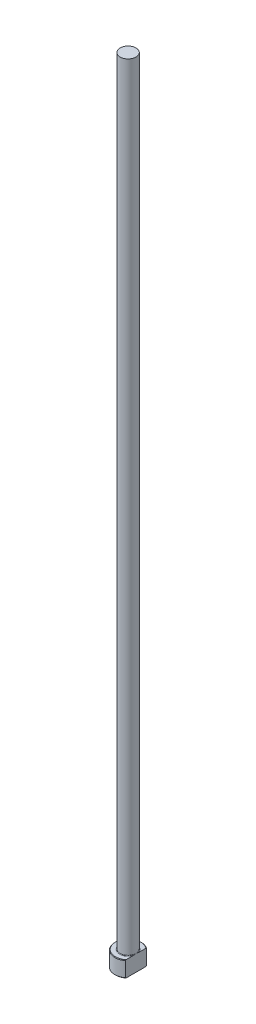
ISO-10303-21;
HEADER;
FILE_DESCRIPTION(('STEP AP214'),'2;1');
FILE_NAME('part.step','',(''),(''),'','','');
FILE_SCHEMA(('AUTOMOTIVE_DESIGN { 1 0 10303 214 1 1 1 1 }'));
ENDSEC;
DATA;
#1=APPLICATION_CONTEXT('core data for automotive mechanical design processes');
#2=APPLICATION_PROTOCOL_DEFINITION('international standard','automotive_design',2000,#1);
#3=PRODUCT_CONTEXT('',#1,'mechanical');
#4=PRODUCT('Part','Part','',(#3));
#5=PRODUCT_RELATED_PRODUCT_CATEGORY('part','',(#4));
#6=PRODUCT_DEFINITION_FORMATION('','',#4);
#7=PRODUCT_DEFINITION_CONTEXT('part definition',#1,'design');
#8=PRODUCT_DEFINITION('design','',#6,#7);
#9=PRODUCT_DEFINITION_SHAPE('','',#8);
#10=(LENGTH_UNIT() NAMED_UNIT(*) SI_UNIT(.MILLI.,.METRE.));
#11=(NAMED_UNIT(*) PLANE_ANGLE_UNIT() SI_UNIT($,.RADIAN.));
#12=(NAMED_UNIT(*) SI_UNIT($,.STERADIAN.) SOLID_ANGLE_UNIT());
#13=UNCERTAINTY_MEASURE_WITH_UNIT(LENGTH_MEASURE(1.E-05),#10,'distance_accuracy_value','');
#14=(GEOMETRIC_REPRESENTATION_CONTEXT(3) GLOBAL_UNCERTAINTY_ASSIGNED_CONTEXT((#13)) GLOBAL_UNIT_ASSIGNED_CONTEXT((#10,
#11,#12)) REPRESENTATION_CONTEXT('',''));
#15=CARTESIAN_POINT('',(0.,0.,0.));
#16=DIRECTION('',(0.,0.,1.));
#17=DIRECTION('',(1.,0.,0.));
#18=AXIS2_PLACEMENT_3D('',#15,#16,#17);
#19=CARTESIAN_POINT('',(0.,0.,0.));
#20=DIRECTION('',(0.,-1.,0.));
#21=DIRECTION('',(0.,0.,-1.));
#22=AXIS2_PLACEMENT_3D('',#19,#20,#21);
#23=PLANE('',#22);
#24=CARTESIAN_POINT('',(0.,0.,0.));
#25=DIRECTION('',(0.,-1.,0.));
#26=DIRECTION('',(0.,0.,-1.));
#27=AXIS2_PLACEMENT_3D('',#24,#25,#26);
#28=CIRCLE('',#27,4.79999999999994);
#29=CARTESIAN_POINT('',(2.99999999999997,0.,3.74699879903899));
#30=VERTEX_POINT('',#29);
#31=CARTESIAN_POINT('',(2.99999999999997,0.,-3.74699879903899));
#32=VERTEX_POINT('',#31);
#33=EDGE_CURVE('E98',#30,#32,#28,.T.);
#34=ORIENTED_EDGE('',*,*,#33,.T.);
#35=DIRECTION('',(0.,0.,1.));
#36=VECTOR('',#35,1.);
#37=CARTESIAN_POINT('',(2.99999999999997,0.,3.99999999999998));
#38=LINE('',#37,#36);
#39=EDGE_CURVE('E83',#32,#30,#38,.T.);
#40=ORIENTED_EDGE('',*,*,#39,.T.);
#41=EDGE_LOOP('',(#34,#40));
#42=FACE_BOUND('',#41,.T.);
#43=ADVANCED_FACE('F32',(#42),#23,.T.);
#44=CARTESIAN_POINT('',(0.,259.958771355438,0.));
#45=DIRECTION('',(0.,1.,0.));
#46=DIRECTION('',(0.,0.,1.));
#47=AXIS2_PLACEMENT_3D('',#44,#45,#46);
#48=CYLINDRICAL_SURFACE('',#47,4.99999999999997);
#49=CARTESIAN_POINT('',(0.,5.79999999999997,0.));
#50=DIRECTION('',(0.,1.,0.));
#51=DIRECTION('',(0.,0.,1.));
#52=AXIS2_PLACEMENT_3D('',#49,#50,#51);
#53=CIRCLE('',#52,4.99999999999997);
#54=CARTESIAN_POINT('',(2.99999999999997,5.79999999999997,3.99999999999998));
#55=VERTEX_POINT('',#54);
#56=CARTESIAN_POINT('',(2.99999999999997,5.79999999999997,-3.99999999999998));
#57=VERTEX_POINT('',#56);
#58=EDGE_CURVE('E104',#55,#57,#53,.F.);
#59=ORIENTED_EDGE('',*,*,#58,.T.);
#60=DIRECTION('',(0.,-1.,0.));
#61=VECTOR('',#60,1.);
#62=CARTESIAN_POINT('',(2.99999999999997,300.,-3.99999999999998));
#63=LINE('',#62,#61);
#64=CARTESIAN_POINT('',(2.99999999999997,0.200000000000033,-3.99999999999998));
#65=VERTEX_POINT('',#64);
#66=EDGE_CURVE('E183',#57,#65,#63,.T.);
#67=ORIENTED_EDGE('',*,*,#66,.T.);
#68=CARTESIAN_POINT('',(0.,0.200000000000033,0.));
#69=DIRECTION('',(0.,-1.,0.));
#70=DIRECTION('',(0.,0.,-1.));
#71=AXIS2_PLACEMENT_3D('',#68,#69,#70);
#72=CIRCLE('',#71,4.99999999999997);
#73=CARTESIAN_POINT('',(2.99999999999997,0.200000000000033,3.99999999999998));
#74=VERTEX_POINT('',#73);
#75=EDGE_CURVE('E100',#65,#74,#72,.F.);
#76=ORIENTED_EDGE('',*,*,#75,.T.);
#77=DIRECTION('',(0.,-1.,0.));
#78=VECTOR('',#77,1.);
#79=CARTESIAN_POINT('',(2.99999999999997,300.,3.99999999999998));
#80=LINE('',#79,#78);
#81=EDGE_CURVE('E93',#55,#74,#80,.T.);
#82=ORIENTED_EDGE('',*,*,#81,.F.);
#83=EDGE_LOOP('',(#59,#67,#76,#82));
#84=FACE_BOUND('',#83,.T.);
#85=ADVANCED_FACE('F158',(#84),#48,.T.);
#86=CARTESIAN_POINT('',(-4.99999999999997,6.,0.));
#87=DIRECTION('',(0.,1.,0.));
#88=DIRECTION('',(0.,0.,1.));
#89=AXIS2_PLACEMENT_3D('',#86,#87,#88);
#90=PLANE('',#89);
#91=CARTESIAN_POINT('',(0.,6.,0.));
#92=DIRECTION('',(0.,1.,0.));
#93=DIRECTION('',(0.,0.,1.));
#94=AXIS2_PLACEMENT_3D('',#91,#92,#93);
#95=CIRCLE('',#94,4.79999999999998);
#96=CARTESIAN_POINT('',(2.99999999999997,6.,-3.74699879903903));
#97=VERTEX_POINT('',#96);
#98=CARTESIAN_POINT('',(2.99999999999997,6.,3.74699879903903));
#99=VERTEX_POINT('',#98);
#100=EDGE_CURVE('E178',#97,#99,#95,.T.);
#101=ORIENTED_EDGE('',*,*,#100,.T.);
#102=DIRECTION('',(0.,0.,-1.));
#103=VECTOR('',#102,1.);
#104=CARTESIAN_POINT('',(2.99999999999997,6.,0.));
#105=LINE('',#104,#103);
#106=CARTESIAN_POINT('',(2.99999999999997,5.99999999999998,1.11355287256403));
#107=VERTEX_POINT('',#106);
#108=EDGE_CURVE('E57',#99,#107,#105,.T.);
#109=ORIENTED_EDGE('',*,*,#108,.T.);
#110=CARTESIAN_POINT('',(0.,6.,0.));
#111=DIRECTION('',(0.,1.,0.));
#112=DIRECTION('',(0.,0.,1.));
#113=AXIS2_PLACEMENT_3D('',#110,#111,#112);
#114=CIRCLE('',#113,3.19999999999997);
#115=CARTESIAN_POINT('',(2.99999999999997,5.99999999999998,-1.113552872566));
#116=VERTEX_POINT('',#115);
#117=EDGE_CURVE('E107',#107,#116,#114,.F.);
#118=ORIENTED_EDGE('',*,*,#117,.T.);
#119=EDGE_CURVE('E136',#116,#97,#105,.T.);
#120=ORIENTED_EDGE('',*,*,#119,.T.);
#121=EDGE_LOOP('',(#101,#109,#118,#120));
#122=FACE_BOUND('',#121,.T.);
#123=ADVANCED_FACE('F147',(#122),#90,.T.);
#124=CARTESIAN_POINT('',(0.,6.00000000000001,0.));
#125=DIRECTION('',(0.,-1.,0.));
#126=DIRECTION('',(0.,0.,-1.));
#127=AXIS2_PLACEMENT_3D('',#124,#125,#126);
#128=CONICAL_SURFACE('',#127,4.79999999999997,0.785398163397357);
#129=ORIENTED_EDGE('',*,*,#58,.F.);
#130=CARTESIAN_POINT('',(2.99999999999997,1.50107969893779,8.80169976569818));
#131=CARTESIAN_POINT('',(2.99999999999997,1.63686222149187,8.65824370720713));
#132=CARTESIAN_POINT('',(2.99999999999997,1.77246571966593,8.51461803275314));
#133=CARTESIAN_POINT('',(2.99999999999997,2.04325136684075,8.22696847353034));
#134=CARTESIAN_POINT('',(2.99999999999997,2.17843351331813,8.08294458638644));
#135=CARTESIAN_POINT('',(2.99999999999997,2.58356488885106,7.64985367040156));
#136=CARTESIAN_POINT('',(2.99999999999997,2.85278243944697,7.36010130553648));
#137=CARTESIAN_POINT('',(2.99999999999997,3.40003551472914,6.76562093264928));
#138=CARTESIAN_POINT('',(2.99999999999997,3.67795327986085,6.46078413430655));
#139=CARTESIAN_POINT('',(2.99999999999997,4.09143431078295,6.00077575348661));
#140=CARTESIAN_POINT('',(2.99999999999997,4.22862197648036,5.84706478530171));
#141=CARTESIAN_POINT('',(2.99999999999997,4.50164803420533,5.5384501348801));
#142=CARTESIAN_POINT('',(2.99999999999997,4.63748643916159,5.38354646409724));
#143=CARTESIAN_POINT('',(2.99999999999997,4.90727601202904,5.07249257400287));
#144=CARTESIAN_POINT('',(2.99999999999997,5.04122961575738,4.91634447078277));
#145=CARTESIAN_POINT('',(2.99999999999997,5.30697993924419,4.60220522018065));
#146=CARTESIAN_POINT('',(2.99999999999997,5.43877654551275,4.44421397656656));
#147=CARTESIAN_POINT('',(2.99999999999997,5.69999683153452,4.12534042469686));
#148=CARTESIAN_POINT('',(2.99999999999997,5.82941047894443,3.96444987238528));
#149=CARTESIAN_POINT('',(2.99999999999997,6.08438250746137,3.63966784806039));
#150=CARTESIAN_POINT('',(2.99999999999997,6.20994148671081,3.47577684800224));
#151=CARTESIAN_POINT('',(2.99999999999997,6.45325581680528,3.14739812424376));
#152=CARTESIAN_POINT('',(2.99999999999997,6.57111776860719,2.98298986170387));
#153=CARTESIAN_POINT('',(2.99999999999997,6.79968625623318,2.64903166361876));
#154=CARTESIAN_POINT('',(2.99999999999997,6.91038738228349,2.479477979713));
#155=CARTESIAN_POINT('',(2.99999999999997,7.12046597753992,2.13484547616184));
#156=CARTESIAN_POINT('',(2.99999999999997,7.21990868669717,1.95980688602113));
#157=CARTESIAN_POINT('',(2.99999999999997,7.40271732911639,1.60161809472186));
#158=CARTESIAN_POINT('',(2.99999999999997,7.48611382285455,1.4184841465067));
#159=CARTESIAN_POINT('',(2.99999999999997,7.59087391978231,1.14242184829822));
#160=CARTESIAN_POINT('',(2.99999999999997,7.62169870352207,1.05308812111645));
#161=CARTESIAN_POINT('',(2.99999999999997,7.67691431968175,0.872393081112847));
#162=CARTESIAN_POINT('',(2.99999999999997,7.70130307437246,0.781031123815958));
#163=CARTESIAN_POINT('',(2.99999999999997,7.74245942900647,0.597105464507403));
#164=CARTESIAN_POINT('',(2.99999999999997,7.75926776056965,0.504551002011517));
#165=CARTESIAN_POINT('',(2.99999999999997,7.78456917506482,0.318316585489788));
#166=CARTESIAN_POINT('',(2.99999999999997,7.79306431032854,0.224636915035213));
#167=CARTESIAN_POINT('',(2.99999999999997,7.8012672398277,0.0362345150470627));
#168=CARTESIAN_POINT('',(2.99999999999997,7.80091364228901,-0.0584909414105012));
#169=CARTESIAN_POINT('',(2.99999999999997,7.79128992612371,-0.247479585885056));
#170=CARTESIAN_POINT('',(2.99999999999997,7.78201974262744,-0.341742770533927));
#171=CARTESIAN_POINT('',(2.99999999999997,7.75505711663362,-0.529484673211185));
#172=CARTESIAN_POINT('',(2.99999999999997,7.73732579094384,-0.622957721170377));
#173=CARTESIAN_POINT('',(2.99999999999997,7.69436193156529,-0.808152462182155));
#174=CARTESIAN_POINT('',(2.99999999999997,7.66912783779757,-0.899873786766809));
#175=CARTESIAN_POINT('',(2.99999999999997,7.59536615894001,-1.13513447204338));
#176=CARTESIAN_POINT('',(2.99999999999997,7.54190202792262,-1.2771229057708));
#177=CARTESIAN_POINT('',(2.99999999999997,7.4228806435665,-1.55591594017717));
#178=CARTESIAN_POINT('',(2.99999999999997,7.35731341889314,-1.69271615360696));
#179=CARTESIAN_POINT('',(2.99999999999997,7.21673004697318,-1.9629734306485));
#180=CARTESIAN_POINT('',(2.99999999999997,7.14163008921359,-2.09638641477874));
#181=CARTESIAN_POINT('',(2.99999999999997,7.02409885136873,-2.29351148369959));
#182=CARTESIAN_POINT('',(2.99999999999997,6.98411579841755,-2.3587093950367));
#183=CARTESIAN_POINT('',(2.99999999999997,6.90273519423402,-2.48821412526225));
#184=CARTESIAN_POINT('',(2.99999999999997,6.86133769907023,-2.55252097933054));
#185=CARTESIAN_POINT('',(2.99999999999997,6.72108058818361,-2.76592084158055));
#186=CARTESIAN_POINT('',(2.99999999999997,6.619509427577,-2.91323263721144));
#187=CARTESIAN_POINT('',(2.99999999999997,6.4115868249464,-3.20445576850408));
#188=CARTESIAN_POINT('',(2.99999999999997,6.30523434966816,-3.34836635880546));
#189=CARTESIAN_POINT('',(2.99999999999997,6.08891481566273,-3.63358820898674));
#190=CARTESIAN_POINT('',(2.99999999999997,5.9789453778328,-3.77489765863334));
#191=CARTESIAN_POINT('',(2.99999999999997,5.75630759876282,-4.05537908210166));
#192=CARTESIAN_POINT('',(2.99999999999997,5.64363910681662,-4.19455093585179));
#193=CARTESIAN_POINT('',(2.99999999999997,5.41585487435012,-4.47160548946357));
#194=CARTESIAN_POINT('',(2.99999999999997,5.3007325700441,-4.60948278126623));
#195=CARTESIAN_POINT('',(2.99999999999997,5.0688195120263,-4.88382857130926));
#196=CARTESIAN_POINT('',(2.99999999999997,4.95202872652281,-5.02029704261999));
#197=CARTESIAN_POINT('',(2.99999999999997,4.59976429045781,-5.42786401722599));
#198=CARTESIAN_POINT('',(2.99999999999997,4.36230070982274,-5.69724186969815));
#199=CARTESIAN_POINT('',(2.99999999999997,3.90791057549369,-6.20584337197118));
#200=CARTESIAN_POINT('',(2.99999999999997,3.69132371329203,-6.4453721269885));
#201=CARTESIAN_POINT('',(2.99999999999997,3.25600753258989,-6.92252604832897));
#202=CARTESIAN_POINT('',(2.99999999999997,3.03727796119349,-7.16015098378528));
#203=CARTESIAN_POINT('',(2.99999999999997,2.59963438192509,-7.63242038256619));
#204=CARTESIAN_POINT('',(2.99999999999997,2.38073043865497,-7.86707418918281));
#205=CARTESIAN_POINT('',(2.99999999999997,1.94172655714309,-8.33519393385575));
#206=CARTESIAN_POINT('',(2.99999999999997,1.7216268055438,-8.56866004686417));
#207=CARTESIAN_POINT('',(2.99999999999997,1.50107969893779,-8.80169976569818));
#208=B_SPLINE_CURVE_WITH_KNOTS('',3,(#130,#131,#132,#133,#134,#135,#136,#137,#138,#139,#140,
#141,#142,#143,#144,#145,#146,#147,#148,#149,#150,#151,#152,#153,#154,#155,#156,#157,#158,#159,
#160,#161,#162,#163,#164,#165,#166,#167,#168,#169,#170,#171,#172,#173,#174,#175,#176,#177,#178,
#179,#180,#181,#182,#183,#184,#185,#186,#187,#188,#189,#190,#191,#192,#193,#194,#195,#196,#197,
#198,#199,#200,#201,#202,#203,#204,#205,#206,#207),.UNSPECIFIED.,.F.,.F.,(4,2,2,2,2,2,2,2,2,2,2,
2,2,2,2,2,2,2,2,2,2,2,2,2,2,2,2,2,2,2,2,2,2,2,2,2,2,2,4),(0.,0.592578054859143,1.18515965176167,
2.3717032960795,3.60919781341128,4.2272757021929,4.84534766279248,5.46252965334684,
6.07974401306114,6.69913968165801,7.31843874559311,7.92518229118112,8.53237898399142,
9.13585442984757,9.73816890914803,10.0214813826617,10.3048852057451,10.5867475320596,
10.8685402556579,11.1522885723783,11.4360389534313,11.721106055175,12.006232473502,
12.4605654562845,12.915274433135,13.3743011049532,13.6037325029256,13.8331548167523,
14.3698070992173,14.9065759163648,15.4437051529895,15.9808644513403,16.5197074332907,
17.0585606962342,18.1358079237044,19.1045853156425,20.0734784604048,21.0361950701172,
21.9987655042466),.UNSPECIFIED.);
#209=EDGE_CURVE('E135',#55,#99,#208,.T.);
#210=ORIENTED_EDGE('',*,*,#209,.T.);
#211=ORIENTED_EDGE('',*,*,#100,.F.);
#212=EDGE_CURVE('E127',#97,#57,#208,.T.);
#213=ORIENTED_EDGE('',*,*,#212,.T.);
#214=EDGE_LOOP('',(#129,#210,#211,#213));
#215=FACE_BOUND('',#214,.T.);
#216=ADVANCED_FACE('F143',(#215),#128,.T.);
#217=CARTESIAN_POINT('',(0.,0.200000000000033,0.));
#218=DIRECTION('',(0.,1.,0.));
#219=DIRECTION('',(0.,0.,1.));
#220=AXIS2_PLACEMENT_3D('',#217,#218,#219);
#221=CONICAL_SURFACE('',#220,4.99999999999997,0.785398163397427);
#222=ORIENTED_EDGE('',*,*,#75,.F.);
#223=CARTESIAN_POINT('',(2.99999999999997,4.49892030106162,-8.80169976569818));
#224=CARTESIAN_POINT('',(2.99999999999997,4.36313777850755,-8.65824370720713));
#225=CARTESIAN_POINT('',(2.99999999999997,4.22753428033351,-8.51461803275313));
#226=CARTESIAN_POINT('',(2.99999999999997,3.95674863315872,-8.22696847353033));
#227=CARTESIAN_POINT('',(2.99999999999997,3.82156648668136,-8.08294458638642));
#228=CARTESIAN_POINT('',(2.99999999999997,3.41643511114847,-7.64985367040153));
#229=CARTESIAN_POINT('',(2.99999999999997,3.14721756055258,-7.36010130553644));
#230=CARTESIAN_POINT('',(2.99999999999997,2.59996448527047,-6.76562093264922));
#231=CARTESIAN_POINT('',(2.99999999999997,2.32204672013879,-6.46078413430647));
#232=CARTESIAN_POINT('',(2.99999999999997,1.90856568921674,-6.00077575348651));
#233=CARTESIAN_POINT('',(2.99999999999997,1.77137802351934,-5.84706478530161));
#234=CARTESIAN_POINT('',(2.99999999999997,1.4983519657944,-5.53845013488));
#235=CARTESIAN_POINT('',(2.99999999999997,1.36251356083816,-5.38354646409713));
#236=CARTESIAN_POINT('',(2.99999999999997,1.09272398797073,-5.07249257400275));
#237=CARTESIAN_POINT('',(2.99999999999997,0.958770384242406,-4.91634447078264));
#238=CARTESIAN_POINT('',(2.99999999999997,0.693020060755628,-4.60220522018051));
#239=CARTESIAN_POINT('',(2.99999999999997,0.561223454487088,-4.44421397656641));
#240=CARTESIAN_POINT('',(2.99999999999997,0.300003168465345,-4.1253404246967));
#241=CARTESIAN_POINT('',(2.99999999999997,0.170589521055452,-3.96444987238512));
#242=CARTESIAN_POINT('',(2.99999999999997,-0.0843825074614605,-3.63966784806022));
#243=CARTESIAN_POINT('',(2.99999999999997,-0.209941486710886,-3.47577684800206));
#244=CARTESIAN_POINT('',(2.99999999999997,-0.453255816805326,-3.14739812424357));
#245=CARTESIAN_POINT('',(2.99999999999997,-0.57111776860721,-2.98298986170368));
#246=CARTESIAN_POINT('',(2.99999999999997,-0.799686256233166,-2.64903166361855));
#247=CARTESIAN_POINT('',(2.99999999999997,-0.910387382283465,-2.47947797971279));
#248=CARTESIAN_POINT('',(2.99999999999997,-1.12046597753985,-2.13484547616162));
#249=CARTESIAN_POINT('',(2.99999999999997,-1.21990868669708,-1.95980688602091));
#250=CARTESIAN_POINT('',(2.99999999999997,-1.40271732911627,-1.60161809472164));
#251=CARTESIAN_POINT('',(2.99999999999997,-1.4861138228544,-1.41848414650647));
#252=CARTESIAN_POINT('',(2.99999999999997,-1.59087391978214,-1.14242184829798));
#253=CARTESIAN_POINT('',(2.99999999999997,-1.62169870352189,-1.0530881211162));
#254=CARTESIAN_POINT('',(2.99999999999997,-1.67691431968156,-0.872393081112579));
#255=CARTESIAN_POINT('',(2.99999999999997,-1.70130307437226,-0.781031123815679));
#256=CARTESIAN_POINT('',(2.99999999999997,-1.74245942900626,-0.597105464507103));
#257=CARTESIAN_POINT('',(2.99999999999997,-1.75926776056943,-0.504551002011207));
#258=CARTESIAN_POINT('',(2.99999999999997,-1.78456917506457,-0.318316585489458));
#259=CARTESIAN_POINT('',(2.99999999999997,-1.79306431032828,-0.224636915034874));
#260=CARTESIAN_POINT('',(2.99999999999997,-1.80126723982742,-0.0362345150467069));
#261=CARTESIAN_POINT('',(2.99999999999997,-1.80091364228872,0.0584909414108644));
#262=CARTESIAN_POINT('',(2.99999999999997,-1.7912899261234,0.247479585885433));
#263=CARTESIAN_POINT('',(2.99999999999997,-1.78201974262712,0.341742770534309));
#264=CARTESIAN_POINT('',(2.99999999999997,-1.75505711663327,0.529484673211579));
#265=CARTESIAN_POINT('',(2.99999999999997,-1.73732579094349,0.622957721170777));
#266=CARTESIAN_POINT('',(2.99999999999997,-1.69436193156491,0.808152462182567));
#267=CARTESIAN_POINT('',(2.99999999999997,-1.66912783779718,0.899873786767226));
#268=CARTESIAN_POINT('',(2.99999999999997,-1.59536615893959,1.13513447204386));
#269=CARTESIAN_POINT('',(2.99999999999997,-1.54190202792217,1.27712290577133));
#270=CARTESIAN_POINT('',(2.99999999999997,-1.42288064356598,1.55591594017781));
#271=CARTESIAN_POINT('',(2.99999999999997,-1.35731341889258,1.69271615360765));
#272=CARTESIAN_POINT('',(2.99999999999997,-1.21673004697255,1.96297343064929));
#273=CARTESIAN_POINT('',(2.99999999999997,-1.14163008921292,2.09638641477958));
#274=CARTESIAN_POINT('',(2.99999999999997,-1.024098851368,2.2935114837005));
#275=CARTESIAN_POINT('',(2.99999999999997,-0.984115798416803,2.35870939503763));
#276=CARTESIAN_POINT('',(2.99999999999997,-0.902735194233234,2.48821412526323));
#277=CARTESIAN_POINT('',(2.99999999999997,-0.861337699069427,2.55252097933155));
#278=CARTESIAN_POINT('',(2.99999999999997,-0.721080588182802,2.76592084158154));
#279=CARTESIAN_POINT('',(2.99999999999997,-0.619509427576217,2.91323263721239));
#280=CARTESIAN_POINT('',(2.99999999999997,-0.411586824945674,3.20445576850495));
#281=CARTESIAN_POINT('',(2.99999999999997,-0.305234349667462,3.34836635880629));
#282=CARTESIAN_POINT('',(2.99999999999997,-0.0889148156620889,3.6335882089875));
#283=CARTESIAN_POINT('',(2.99999999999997,0.0210546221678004,3.77489765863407));
#284=CARTESIAN_POINT('',(2.99999999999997,0.243692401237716,4.05537908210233));
#285=CARTESIAN_POINT('',(2.99999999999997,0.356360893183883,4.19455093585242));
#286=CARTESIAN_POINT('',(2.99999999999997,0.584145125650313,4.47160548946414));
#287=CARTESIAN_POINT('',(2.99999999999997,0.699267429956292,4.60948278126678));
#288=CARTESIAN_POINT('',(2.99999999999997,0.931180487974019,4.88382857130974));
#289=CARTESIAN_POINT('',(2.99999999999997,1.04797127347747,5.02029704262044));
#290=CARTESIAN_POINT('',(2.99999999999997,1.40023570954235,5.42786401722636));
#291=CARTESIAN_POINT('',(2.99999999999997,1.63769929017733,5.69724186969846));
#292=CARTESIAN_POINT('',(2.99999999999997,2.09208942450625,6.20584337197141));
#293=CARTESIAN_POINT('',(2.99999999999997,2.30867628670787,6.4453721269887));
#294=CARTESIAN_POINT('',(2.99999999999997,2.74399246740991,6.92252604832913));
#295=CARTESIAN_POINT('',(2.99999999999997,2.96272203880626,7.16015098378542));
#296=CARTESIAN_POINT('',(2.99999999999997,3.40036561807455,7.63242038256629));
#297=CARTESIAN_POINT('',(2.99999999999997,3.61926956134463,7.86707418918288));
#298=CARTESIAN_POINT('',(2.99999999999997,4.05827344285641,8.33519393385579));
#299=CARTESIAN_POINT('',(2.99999999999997,4.27837319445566,8.56866004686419));
#300=CARTESIAN_POINT('',(2.99999999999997,4.49892030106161,8.80169976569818));
#301=B_SPLINE_CURVE_WITH_KNOTS('',3,(#223,#224,#225,#226,#227,#228,#229,#230,#231,#232,#233,
#234,#235,#236,#237,#238,#239,#240,#241,#242,#243,#244,#245,#246,#247,#248,#249,#250,#251,#252,
#253,#254,#255,#256,#257,#258,#259,#260,#261,#262,#263,#264,#265,#266,#267,#268,#269,#270,#271,
#272,#273,#274,#275,#276,#277,#278,#279,#280,#281,#282,#283,#284,#285,#286,#287,#288,#289,#290,
#291,#292,#293,#294,#295,#296,#297,#298,#299,#300),.UNSPECIFIED.,.F.,.F.,(4,2,2,2,2,2,2,2,2,2,2,
2,2,2,2,2,2,2,2,2,2,2,2,2,2,2,2,2,2,2,2,2,2,2,2,2,2,2,4),(0.,0.592578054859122,1.18515965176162,
2.37170329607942,3.60919781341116,4.22727570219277,4.84534766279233,5.46252965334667,
6.07974401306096,6.69913968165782,7.3184387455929,7.92518229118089,8.53237898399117,
9.1358544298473,9.73816890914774,10.0214813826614,10.3048852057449,10.5867475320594,
10.8685402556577,11.1522885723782,11.4360389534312,11.7211060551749,12.0062324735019,
12.4605654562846,12.9152744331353,13.3743011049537,13.6037325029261,13.8331548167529,
14.3698070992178,14.9065759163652,15.4437051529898,15.9808644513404,16.5197074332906,
17.058560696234,18.1358079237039,19.1045853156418,20.073478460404,21.0361950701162,
21.9987655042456),.UNSPECIFIED.);
#302=EDGE_CURVE('E86',#65,#32,#301,.T.);
#303=ORIENTED_EDGE('',*,*,#302,.T.);
#304=ORIENTED_EDGE('',*,*,#33,.F.);
#305=EDGE_CURVE('E89',#30,#74,#301,.T.);
#306=ORIENTED_EDGE('',*,*,#305,.T.);
#307=EDGE_LOOP('',(#222,#303,#304,#306));
#308=FACE_BOUND('',#307,.T.);
#309=ADVANCED_FACE('F97',(#308),#221,.T.);
#310=CARTESIAN_POINT('',(0.,6.19999999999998,0.));
#311=DIRECTION('',(0.,1.,0.));
#312=DIRECTION('',(0.,0.,1.));
#313=AXIS2_PLACEMENT_3D('',#310,#311,#312);
#314=TOROIDAL_SURFACE('',#313,3.19999999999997,0.2);
#315=CARTESIAN_POINT('',(2.99999999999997,6.19999999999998,0.));
#316=CARTESIAN_POINT('',(2.99999999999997,6.20000054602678,-8.25590029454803E-09));
#317=CARTESIAN_POINT('',(2.99999999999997,6.20000108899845,-2.22623717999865E-07));
#318=CARTESIAN_POINT('',(2.99999999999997,6.20000210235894,-8.13181332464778E-07));
#319=CARTESIAN_POINT('',(2.99999999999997,6.20000256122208,-1.20262210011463E-06));
#320=CARTESIAN_POINT('',(2.99999999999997,6.20000351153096,-2.13233194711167E-06));
#321=CARTESIAN_POINT('',(2.99999999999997,6.20000398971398,-2.68711080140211E-06));
#322=CARTESIAN_POINT('',(2.99999999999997,6.20000484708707,-3.8372299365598E-06));
#323=CARTESIAN_POINT('',(2.99999999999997,6.20000522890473,-4.43075975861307E-06));
#324=CARTESIAN_POINT('',(2.99999999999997,6.20000663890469,-6.718054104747E-06));
#325=CARTESIAN_POINT('',(2.99999999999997,6.20000758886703,-8.46267334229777E-06));
#326=CARTESIAN_POINT('',(2.99999999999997,6.20000915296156,-1.19195939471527E-05));
#327=CARTESIAN_POINT('',(2.99999999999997,6.20000978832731,-1.36226968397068E-05));
#328=CARTESIAN_POINT('',(2.99999999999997,6.20001243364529,-2.07785329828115E-05));
#329=CARTESIAN_POINT('',(2.99999999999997,6.20001439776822,-2.62512689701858E-05));
#330=CARTESIAN_POINT('',(2.99999999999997,6.20001730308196,-3.65971254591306E-05));
#331=CARTESIAN_POINT('',(2.99999999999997,6.20001835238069,-4.14397204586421E-05));
#332=CARTESIAN_POINT('',(2.99999999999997,6.20002589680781,-7.68826112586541E-05));
#333=CARTESIAN_POINT('',(2.99999999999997,6.20003169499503,-0.000107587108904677));
#334=CARTESIAN_POINT('',(2.99999999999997,6.20005649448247,-0.000225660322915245));
#335=CARTESIAN_POINT('',(2.99999999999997,6.20007997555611,-0.000312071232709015));
#336=CARTESIAN_POINT('',(2.99999999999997,6.20016717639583,-0.00063874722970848));
#337=CARTESIAN_POINT('',(2.99999999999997,6.20022823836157,-0.00087949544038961));
#338=CARTESIAN_POINT('',(2.99999999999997,6.20046253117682,-0.00179757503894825));
#339=CARTESIAN_POINT('',(2.99999999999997,6.20063826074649,-0.00247448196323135));
#340=CARTESIAN_POINT('',(2.99999999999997,6.20145771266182,-0.00563611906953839));
#341=CARTESIAN_POINT('',(2.99999999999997,6.20209802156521,-0.00812138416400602));
#342=CARTESIAN_POINT('',(2.99999999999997,6.20747052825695,-0.0289666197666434));
#343=CARTESIAN_POINT('',(2.99999999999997,6.21221441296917,-0.0473249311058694));
#344=CARTESIAN_POINT('',(2.99999999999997,6.22150414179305,-0.0833908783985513));
#345=CARTESIAN_POINT('',(2.99999999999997,6.22605099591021,-0.101098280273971));
#346=CARTESIAN_POINT('',(2.99999999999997,6.24071513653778,-0.158441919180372));
#347=CARTESIAN_POINT('',(2.99999999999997,6.25076238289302,-0.198096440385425));
#348=CARTESIAN_POINT('',(2.99999999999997,6.2673587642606,-0.264903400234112));
#349=CARTESIAN_POINT('',(2.99999999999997,6.27400650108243,-0.292031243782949));
#350=CARTESIAN_POINT('',(2.99999999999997,6.28691139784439,-0.345693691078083));
#351=CARTESIAN_POINT('',(2.99999999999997,6.2931740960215,-0.372226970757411));
#352=CARTESIAN_POINT('',(2.99999999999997,6.31359314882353,-0.460847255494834));
#353=CARTESIAN_POINT('',(2.99999999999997,6.32711949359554,-0.523084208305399));
#354=CARTESIAN_POINT('',(2.99999999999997,6.35185224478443,-0.648627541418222));
#355=CARTESIAN_POINT('',(2.99999999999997,6.36303576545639,-0.711938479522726));
#356=CARTESIAN_POINT('',(2.99999999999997,6.38269719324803,-0.845442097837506));
#357=CARTESIAN_POINT('',(2.99999999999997,6.39079783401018,-0.915695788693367));
#358=CARTESIAN_POINT('',(2.99999999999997,6.39788104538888,-1.02128246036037));
#359=CARTESIAN_POINT('',(2.99999999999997,6.39939945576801,-1.05644278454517));
#360=CARTESIAN_POINT('',(2.99999999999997,6.40031405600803,-1.12678521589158));
#361=CARTESIAN_POINT('',(2.99999999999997,6.39971158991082,-1.16196729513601));
#362=CARTESIAN_POINT('',(2.99999999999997,6.39660553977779,-1.21713951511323));
#363=CARTESIAN_POINT('',(2.99999999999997,6.39502683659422,-1.23718181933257));
#364=CARTESIAN_POINT('',(2.99999999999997,6.39080008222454,-1.27717351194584));
#365=CARTESIAN_POINT('',(2.99999999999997,6.38815120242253,-1.29712281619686));
#366=CARTESIAN_POINT('',(2.99999999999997,6.38160570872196,-1.33655702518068));
#367=CARTESIAN_POINT('',(2.99999999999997,6.37772556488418,-1.35604460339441));
#368=CARTESIAN_POINT('',(2.99999999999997,6.36841119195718,-1.39463554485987));
#369=CARTESIAN_POINT('',(2.99999999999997,6.36297874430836,-1.41373932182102));
#370=CARTESIAN_POINT('',(2.99999999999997,6.3500393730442,-1.45151809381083));
#371=CARTESIAN_POINT('',(2.99999999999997,6.34250654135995,-1.4701843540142));
#372=CARTESIAN_POINT('',(2.99999999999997,6.32469433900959,-1.50617232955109));
#373=CARTESIAN_POINT('',(2.99999999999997,6.31442814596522,-1.52349999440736));
#374=CARTESIAN_POINT('',(2.99999999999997,6.29768486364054,-1.5453003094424));
#375=CARTESIAN_POINT('',(2.99999999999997,6.29285641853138,-1.551032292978));
#376=CARTESIAN_POINT('',(2.99999999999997,6.28257691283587,-1.56192749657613));
#377=CARTESIAN_POINT('',(2.99999999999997,6.27712536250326,-1.56709026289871));
#378=CARTESIAN_POINT('',(2.99999999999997,6.26548354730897,-1.57666725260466));
#379=CARTESIAN_POINT('',(2.99999999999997,6.25928560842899,-1.58107232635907));
#380=CARTESIAN_POINT('',(2.99999999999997,6.24620912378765,-1.5887219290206));
#381=CARTESIAN_POINT('',(2.99999999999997,6.23933242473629,-1.59196950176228));
#382=CARTESIAN_POINT('',(2.99999999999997,6.2270240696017,-1.5962468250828));
#383=CARTESIAN_POINT('',(2.99999999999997,6.2217197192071,-1.59764171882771));
#384=CARTESIAN_POINT('',(2.99999999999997,6.2109516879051,-1.59951721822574));
#385=CARTESIAN_POINT('',(2.99999999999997,6.20548813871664,-1.59999855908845));
#386=CARTESIAN_POINT('',(2.99999999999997,6.19455397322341,-1.60000143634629));
#387=CARTESIAN_POINT('',(2.99999999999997,6.18908335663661,-1.59952177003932));
#388=CARTESIAN_POINT('',(2.99999999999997,6.17830149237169,-1.59764696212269));
#389=CARTESIAN_POINT('',(2.99999999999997,6.17299036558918,-1.59625114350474));
#390=CARTESIAN_POINT('',(2.99999999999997,6.16137413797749,-1.5922159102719));
#391=CARTESIAN_POINT('',(2.99999999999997,6.15514663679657,-1.58935479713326));
#392=CARTESIAN_POINT('',(2.99999999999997,6.14323789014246,-1.58266473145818));
#393=CARTESIAN_POINT('',(2.99999999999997,6.13755768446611,-1.57883398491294));
#394=CARTESIAN_POINT('',(2.99999999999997,6.12388989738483,-1.5682309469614));
#395=CARTESIAN_POINT('',(2.99999999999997,6.11627920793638,-1.5609769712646));
#396=CARTESIAN_POINT('',(2.99999999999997,6.10222993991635,-1.54541986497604));
#397=CARTESIAN_POINT('',(2.99999999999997,6.09579438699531,-1.53711411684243));
#398=CARTESIAN_POINT('',(2.99999999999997,6.07874447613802,-1.51234359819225));
#399=CARTESIAN_POINT('',(2.99999999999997,6.06934681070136,-1.49505024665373));
#400=CARTESIAN_POINT('',(2.99999999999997,6.05300413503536,-1.45936637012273));
#401=CARTESIAN_POINT('',(2.99999999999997,6.04606563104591,-1.44097308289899));
#402=CARTESIAN_POINT('',(2.99999999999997,6.03343712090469,-1.40170303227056));
#403=CARTESIAN_POINT('',(2.99999999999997,6.02794514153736,-1.38076360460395));
#404=CARTESIAN_POINT('',(2.99999999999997,6.01869119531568,-1.33849708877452));
#405=CARTESIAN_POINT('',(2.99999999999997,6.01493126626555,-1.31716957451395));
#406=CARTESIAN_POINT('',(2.99999999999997,6.00879575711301,-1.27427301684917));
#407=CARTESIAN_POINT('',(2.99999999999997,6.0064232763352,-1.25270354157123));
#408=CARTESIAN_POINT('',(2.99999999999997,6.00283272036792,-1.2094871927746));
#409=CARTESIAN_POINT('',(2.99999999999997,6.00161392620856,-1.18784037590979));
#410=CARTESIAN_POINT('',(2.99999999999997,5.99921193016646,-1.11739576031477));
#411=CARTESIAN_POINT('',(2.99999999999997,5.99998309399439,-1.06853061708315));
#412=CARTESIAN_POINT('',(2.99999999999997,6.0049845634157,-0.970964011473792));
#413=CARTESIAN_POINT('',(2.99999999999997,6.00921876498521,-0.922262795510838));
#414=CARTESIAN_POINT('',(2.99999999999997,6.02027934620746,-0.825023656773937));
#415=CARTESIAN_POINT('',(2.99999999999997,6.02711306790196,-0.776486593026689));
#416=CARTESIAN_POINT('',(2.99999999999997,6.04272509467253,-0.679720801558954));
#417=CARTESIAN_POINT('',(2.99999999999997,6.05150395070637,-0.631492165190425));
#418=CARTESIAN_POINT('',(2.99999999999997,6.07999589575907,-0.487173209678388));
#419=CARTESIAN_POINT('',(2.99999999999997,6.10185558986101,-0.39151417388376));
#420=CARTESIAN_POINT('',(2.99999999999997,6.14819769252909,-0.200831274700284));
#421=CARTESIAN_POINT('',(2.99999999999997,6.17268119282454,-0.105807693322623));
#422=CARTESIAN_POINT('',(2.99999999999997,6.19722910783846,-0.01073189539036));
#423=CARTESIAN_POINT('',(2.99999999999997,6.1972452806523,-0.0106692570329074));
#424=CARTESIAN_POINT('',(2.99999999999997,6.19781243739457,-0.00847232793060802));
#425=CARTESIAN_POINT('',(2.99999999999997,6.19836102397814,-0.00633759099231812));
#426=CARTESIAN_POINT('',(2.99999999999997,6.19915976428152,-0.00325873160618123));
#427=CARTESIAN_POINT('',(2.99999999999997,6.19940591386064,-0.0023138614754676));
#428=CARTESIAN_POINT('',(2.99999999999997,6.19972567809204,-0.00105818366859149));
#429=CARTESIAN_POINT('',(2.99999999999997,6.1998040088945,-0.000748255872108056));
#430=CARTESIAN_POINT('',(2.99999999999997,6.19991224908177,-0.0003408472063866));
#431=CARTESIAN_POINT('',(2.99999999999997,6.19993871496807,-0.000242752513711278));
#432=CARTESIAN_POINT('',(2.99999999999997,6.1999662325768,-0.000111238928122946));
#433=CARTESIAN_POINT('',(2.99999999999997,6.19997237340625,-7.8903777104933E-05));
#434=CARTESIAN_POINT('',(2.99999999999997,6.19998062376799,-4.17973013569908E-05));
#435=CARTESIAN_POINT('',(2.99999999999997,6.1999817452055,-3.68646326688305E-05));
#436=CARTESIAN_POINT('',(2.99999999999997,6.19998486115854,-2.63337098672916E-05));
#437=CARTESIAN_POINT('',(2.99999999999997,6.19998697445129,-2.07707790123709E-05));
#438=CARTESIAN_POINT('',(2.99999999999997,6.19998981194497,-1.35213137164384E-05));
#439=CARTESIAN_POINT('',(2.99999999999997,6.19999048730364,-1.18115060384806E-05));
#440=CARTESIAN_POINT('',(2.99999999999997,6.19999214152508,-8.34771964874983E-06));
#441=CARTESIAN_POINT('',(2.99999999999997,6.19999314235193,-6.60378872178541E-06));
#442=CARTESIAN_POINT('',(2.99999999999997,6.19999462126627,-4.32501646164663E-06));
#443=CARTESIAN_POINT('',(2.99999999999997,6.19999502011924,-3.73587510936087E-06));
#444=CARTESIAN_POINT('',(2.99999999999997,6.19999591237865,-2.59760769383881E-06));
#445=CARTESIAN_POINT('',(2.99999999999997,6.19999640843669,-2.05040430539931E-06));
#446=CARTESIAN_POINT('',(2.99999999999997,6.19999738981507,-1.1384674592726E-06));
#447=CARTESIAN_POINT('',(2.99999999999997,6.1999978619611,-7.58552555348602E-07));
#448=CARTESIAN_POINT('',(2.99999999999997,6.19999889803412,-1.92079007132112E-07));
#449=CARTESIAN_POINT('',(2.99999999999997,6.19999945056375,8.30745072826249E-09));
#450=CARTESIAN_POINT('',(2.99999999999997,6.19999999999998,0.));
#451=B_SPLINE_CURVE_WITH_KNOTS('',3,(#315,#316,#317,#318,#319,#320,#321,#322,#323,#324,#325,
#326,#327,#328,#329,#330,#331,#332,#333,#334,#335,#336,#337,#338,#339,#340,#341,#342,#343,#344,
#345,#346,#347,#348,#349,#350,#351,#352,#353,#354,#355,#356,#357,#358,#359,#360,#361,#362,#363,
#364,#365,#366,#367,#368,#369,#370,#371,#372,#373,#374,#375,#376,#377,#378,#379,#380,#381,#382,
#383,#384,#385,#386,#387,#388,#389,#390,#391,#392,#393,#394,#395,#396,#397,#398,#399,#400,#401,
#402,#403,#404,#405,#406,#407,#408,#409,#410,#411,#412,#413,#414,#415,#416,#417,#418,#419,#420,
#421,#422,#423,#424,#425,#426,#427,#428,#429,#430,#431,#432,#433,#434,#435,#436,#437,#438,#439,
#440,#441,#442,#443,#444,#445,#446,#447,#448,#449,#450),.UNSPECIFIED.,.T.,.F.,(4,2,2,2,2,2,2,2,
2,2,2,2,2,2,2,2,2,2,2,2,2,2,2,2,2,2,2,2,2,2,2,2,2,2,2,2,2,2,2,2,2,2,2,2,2,2,2,2,2,2,2,2,2,2,2,2,
2,2,2,2,2,2,2,2,2,2,2,4),(0.,1.65204690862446E-06,3.45848791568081E-06,5.64280248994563E-06,
7.75882419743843E-06,1.36969709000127E-05,1.91454439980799E-05,3.65603921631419E-05,
5.14083081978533E-05,0.000145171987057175,0.00041354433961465,0.00115890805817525,
0.00325667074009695,0.0109563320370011,0.0678386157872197,0.12268455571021,0.245405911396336,
0.329196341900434,0.410983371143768,0.602016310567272,0.794836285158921,1.0067376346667,
1.11227258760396,1.21774067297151,1.27803175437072,1.33836960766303,1.39793215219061,
1.45742661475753,1.51769013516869,1.57766822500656,1.60011625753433,1.62258205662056,
1.64530254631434,1.66796284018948,1.68434680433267,1.70071757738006,1.71710885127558,
1.7335122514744,1.75395806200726,1.77444198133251,1.8058056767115,1.83724902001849,
1.89596356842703,1.95483231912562,2.01967230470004,2.08458838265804,2.14964892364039,
2.21466889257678,2.36107995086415,2.50765595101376,2.65464904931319,2.8016838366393,
3.09594779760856,3.39033467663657,3.39052875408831,3.39714155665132,3.40007033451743,
3.40102967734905,3.40133420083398,3.40143296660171,3.40144812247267,3.4014659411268,
3.40147145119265,3.40147746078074,3.40147959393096,3.40148179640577,3.40148361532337,
3.40148527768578),.UNSPECIFIED.);
#452=CARTESIAN_POINT('',(2.99999999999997,6.19999999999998,0.));
#453=VERTEX_POINT('',#452);
#454=EDGE_CURVE('E11',#116,#453,#451,.T.);
#455=ORIENTED_EDGE('',*,*,#454,.F.);
#456=ORIENTED_EDGE('',*,*,#117,.F.);
#457=CARTESIAN_POINT('',(2.99999999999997,6.19999999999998,0.));
#458=CARTESIAN_POINT('',(2.99999999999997,6.19999945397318,8.25590052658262E-09));
#459=CARTESIAN_POINT('',(2.99999999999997,6.19999891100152,2.22623718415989E-07));
#460=CARTESIAN_POINT('',(2.99999999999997,6.19999789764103,8.13181332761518E-07));
#461=CARTESIAN_POINT('',(2.99999999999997,6.19999743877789,1.2026221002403E-06));
#462=CARTESIAN_POINT('',(2.99999999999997,6.19999648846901,2.13233194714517E-06));
#463=CARTESIAN_POINT('',(2.99999999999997,6.19999601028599,2.68711080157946E-06));
#464=CARTESIAN_POINT('',(2.99999999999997,6.1999951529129,3.83722993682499E-06));
#465=CARTESIAN_POINT('',(2.99999999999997,6.19999477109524,4.43075975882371E-06));
#466=CARTESIAN_POINT('',(2.99999999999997,6.19999336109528,6.7180541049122E-06));
#467=CARTESIAN_POINT('',(2.99999999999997,6.19999241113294,8.4626733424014E-06));
#468=CARTESIAN_POINT('',(2.99999999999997,6.19999084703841,1.19195939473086E-05));
#469=CARTESIAN_POINT('',(2.99999999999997,6.19999021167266,1.36226968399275E-05));
#470=CARTESIAN_POINT('',(2.99999999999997,6.19998756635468,2.07785329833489E-05));
#471=CARTESIAN_POINT('',(2.99999999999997,6.19998560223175,2.62512689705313E-05));
#472=CARTESIAN_POINT('',(2.99999999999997,6.19998269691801,3.65971254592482E-05));
#473=CARTESIAN_POINT('',(2.99999999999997,6.19998164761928,4.14397204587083E-05));
#474=CARTESIAN_POINT('',(2.99999999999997,6.19997410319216,7.68826112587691E-05));
#475=CARTESIAN_POINT('',(2.99999999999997,6.19996830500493,0.000107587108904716));
#476=CARTESIAN_POINT('',(2.99999999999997,6.1999435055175,0.000225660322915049));
#477=CARTESIAN_POINT('',(2.99999999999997,6.19992002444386,0.000312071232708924));
#478=CARTESIAN_POINT('',(2.99999999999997,6.19983282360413,0.000638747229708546));
#479=CARTESIAN_POINT('',(2.99999999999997,6.1997717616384,0.000879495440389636));
#480=CARTESIAN_POINT('',(2.99999999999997,6.19953746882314,0.00179757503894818));
#481=CARTESIAN_POINT('',(2.99999999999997,6.19936173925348,0.00247448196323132));
#482=CARTESIAN_POINT('',(2.99999999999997,6.19854228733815,0.0056361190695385));
#483=CARTESIAN_POINT('',(2.99999999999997,6.19790197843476,0.00812138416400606));
#484=CARTESIAN_POINT('',(2.99999999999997,6.19252947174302,0.0289666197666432));
#485=CARTESIAN_POINT('',(2.99999999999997,6.1877855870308,0.0473249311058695));
#486=CARTESIAN_POINT('',(2.99999999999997,6.17849585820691,0.0833908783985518));
#487=CARTESIAN_POINT('',(2.99999999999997,6.17394900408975,0.101098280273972));
#488=CARTESIAN_POINT('',(2.99999999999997,6.15928486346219,0.158441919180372));
#489=CARTESIAN_POINT('',(2.99999999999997,6.14923761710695,0.198096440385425));
#490=CARTESIAN_POINT('',(2.99999999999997,6.13264123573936,0.264903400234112));
#491=CARTESIAN_POINT('',(2.99999999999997,6.12599349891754,0.292031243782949));
#492=CARTESIAN_POINT('',(2.99999999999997,6.11308860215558,0.345693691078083));
#493=CARTESIAN_POINT('',(2.99999999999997,6.10682590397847,0.372226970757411));
#494=CARTESIAN_POINT('',(2.99999999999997,6.08640685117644,0.460847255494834));
#495=CARTESIAN_POINT('',(2.99999999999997,6.07288050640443,0.523084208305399));
#496=CARTESIAN_POINT('',(2.99999999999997,6.04814775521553,0.648627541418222));
#497=CARTESIAN_POINT('',(2.99999999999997,6.03696423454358,0.711938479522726));
#498=CARTESIAN_POINT('',(2.99999999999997,6.01730280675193,0.845442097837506));
#499=CARTESIAN_POINT('',(2.99999999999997,6.00920216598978,0.915695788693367));
#500=CARTESIAN_POINT('',(2.99999999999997,6.00211895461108,1.02128246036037));
#501=CARTESIAN_POINT('',(2.99999999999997,6.00060054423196,1.05644278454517));
#502=CARTESIAN_POINT('',(2.99999999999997,5.99968594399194,1.12678521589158));
#503=CARTESIAN_POINT('',(2.99999999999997,6.00028841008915,1.16196729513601));
#504=CARTESIAN_POINT('',(2.99999999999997,6.00339446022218,1.21713951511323));
#505=CARTESIAN_POINT('',(2.99999999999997,6.00497316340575,1.23718181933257));
#506=CARTESIAN_POINT('',(2.99999999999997,6.00919991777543,1.27717351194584));
#507=CARTESIAN_POINT('',(2.99999999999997,6.01184879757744,1.29712281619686));
#508=CARTESIAN_POINT('',(2.99999999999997,6.01839429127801,1.33655702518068));
#509=CARTESIAN_POINT('',(2.99999999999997,6.02227443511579,1.35604460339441));
#510=CARTESIAN_POINT('',(2.99999999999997,6.03158880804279,1.39463554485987));
#511=CARTESIAN_POINT('',(2.99999999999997,6.0370212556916,1.41373932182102));
#512=CARTESIAN_POINT('',(2.99999999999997,6.04996062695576,1.45151809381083));
#513=CARTESIAN_POINT('',(2.99999999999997,6.05749345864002,1.4701843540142));
#514=CARTESIAN_POINT('',(2.99999999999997,6.07530566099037,1.50617232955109));
#515=CARTESIAN_POINT('',(2.99999999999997,6.08557185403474,1.52349999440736));
#516=CARTESIAN_POINT('',(2.99999999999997,6.10231513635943,1.5453003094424));
#517=CARTESIAN_POINT('',(2.99999999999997,6.10714358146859,1.551032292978));
#518=CARTESIAN_POINT('',(2.99999999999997,6.1174230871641,1.56192749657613));
#519=CARTESIAN_POINT('',(2.99999999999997,6.1228746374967,1.56709026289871));
#520=CARTESIAN_POINT('',(2.99999999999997,6.13451645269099,1.57666725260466));
#521=CARTESIAN_POINT('',(2.99999999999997,6.14071439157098,1.58107232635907));
#522=CARTESIAN_POINT('',(2.99999999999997,6.15379087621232,1.5887219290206));
#523=CARTESIAN_POINT('',(2.99999999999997,6.16066757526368,1.59196950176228));
#524=CARTESIAN_POINT('',(2.99999999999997,6.17297593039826,1.5962468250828));
#525=CARTESIAN_POINT('',(2.99999999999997,6.17828028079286,1.59764171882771));
#526=CARTESIAN_POINT('',(2.99999999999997,6.18904831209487,1.59951721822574));
#527=CARTESIAN_POINT('',(2.99999999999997,6.19451186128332,1.59999855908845));
#528=CARTESIAN_POINT('',(2.99999999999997,6.20544602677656,1.60000143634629));
#529=CARTESIAN_POINT('',(2.99999999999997,6.21091664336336,1.59952177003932));
#530=CARTESIAN_POINT('',(2.99999999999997,6.22169850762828,1.59764696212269));
#531=CARTESIAN_POINT('',(2.99999999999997,6.22700963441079,1.59625114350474));
#532=CARTESIAN_POINT('',(2.99999999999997,6.23862586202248,1.5922159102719));
#533=CARTESIAN_POINT('',(2.99999999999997,6.2448533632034,1.58935479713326));
#534=CARTESIAN_POINT('',(2.99999999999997,6.25676210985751,1.58266473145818));
#535=CARTESIAN_POINT('',(2.99999999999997,6.26244231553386,1.57883398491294));
#536=CARTESIAN_POINT('',(2.99999999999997,6.27611010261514,1.5682309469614));
#537=CARTESIAN_POINT('',(2.99999999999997,6.28372079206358,1.5609769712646));
#538=CARTESIAN_POINT('',(2.99999999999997,6.29777006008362,1.54541986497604));
#539=CARTESIAN_POINT('',(2.99999999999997,6.30420561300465,1.53711411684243));
#540=CARTESIAN_POINT('',(2.99999999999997,6.32125552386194,1.51234359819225));
#541=CARTESIAN_POINT('',(2.99999999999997,6.33065318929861,1.49505024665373));
#542=CARTESIAN_POINT('',(2.99999999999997,6.3469958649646,1.45936637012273));
#543=CARTESIAN_POINT('',(2.99999999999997,6.35393436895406,1.44097308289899));
#544=CARTESIAN_POINT('',(2.99999999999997,6.36656287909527,1.40170303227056));
#545=CARTESIAN_POINT('',(2.99999999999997,6.37205485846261,1.38076360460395));
#546=CARTESIAN_POINT('',(2.99999999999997,6.38130880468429,1.33849708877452));
#547=CARTESIAN_POINT('',(2.99999999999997,6.38506873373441,1.31716957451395));
#548=CARTESIAN_POINT('',(2.99999999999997,6.39120424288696,1.27427301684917));
#549=CARTESIAN_POINT('',(2.99999999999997,6.39357672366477,1.25270354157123));
#550=CARTESIAN_POINT('',(2.99999999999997,6.39716727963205,1.2094871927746));
#551=CARTESIAN_POINT('',(2.99999999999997,6.39838607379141,1.18784037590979));
#552=CARTESIAN_POINT('',(2.99999999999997,6.40078806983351,1.11739576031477));
#553=CARTESIAN_POINT('',(2.99999999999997,6.40001690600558,1.06853061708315));
#554=CARTESIAN_POINT('',(2.99999999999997,6.39501543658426,0.970964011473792));
#555=CARTESIAN_POINT('',(2.99999999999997,6.39078123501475,0.922262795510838));
#556=CARTESIAN_POINT('',(2.99999999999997,6.37972065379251,0.825023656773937));
#557=CARTESIAN_POINT('',(2.99999999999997,6.37288693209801,0.776486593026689));
#558=CARTESIAN_POINT('',(2.99999999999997,6.35727490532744,0.679720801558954));
#559=CARTESIAN_POINT('',(2.99999999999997,6.34849604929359,0.631492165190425));
#560=CARTESIAN_POINT('',(2.99999999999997,6.3200041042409,0.487173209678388));
#561=CARTESIAN_POINT('',(2.99999999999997,6.29814441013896,0.39151417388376));
#562=CARTESIAN_POINT('',(2.99999999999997,6.25180230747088,0.200831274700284));
#563=CARTESIAN_POINT('',(2.99999999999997,6.22731880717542,0.105807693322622));
#564=CARTESIAN_POINT('',(2.99999999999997,6.2027708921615,0.01073189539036));
#565=CARTESIAN_POINT('',(2.99999999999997,6.20275471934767,0.0106692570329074));
#566=CARTESIAN_POINT('',(2.99999999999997,6.20218756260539,0.008472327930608));
#567=CARTESIAN_POINT('',(2.99999999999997,6.20163897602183,0.0063375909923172));
#568=CARTESIAN_POINT('',(2.99999999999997,6.20084023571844,0.00325873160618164));
#569=CARTESIAN_POINT('',(2.99999999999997,6.20059408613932,0.00231386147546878));
#570=CARTESIAN_POINT('',(2.99999999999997,6.20027432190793,0.00105818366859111));
#571=CARTESIAN_POINT('',(2.99999999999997,6.20019599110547,0.000748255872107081));
#572=CARTESIAN_POINT('',(2.99999999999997,6.20008775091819,0.000340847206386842));
#573=CARTESIAN_POINT('',(2.99999999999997,6.20006128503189,0.000242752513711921));
#574=CARTESIAN_POINT('',(2.99999999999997,6.20003376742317,0.000111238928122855));
#575=CARTESIAN_POINT('',(2.99999999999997,6.20002762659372,7.89037771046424E-05));
#576=CARTESIAN_POINT('',(2.99999999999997,6.20001937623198,4.1797301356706E-05));
#577=CARTESIAN_POINT('',(2.99999999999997,6.20001825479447,3.68646326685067E-05));
#578=CARTESIAN_POINT('',(2.99999999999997,6.20001513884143,2.63337098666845E-05));
#579=CARTESIAN_POINT('',(2.99999999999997,6.20001302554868,2.07707790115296E-05));
#580=CARTESIAN_POINT('',(2.99999999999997,6.20001018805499,1.35213137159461E-05));
#581=CARTESIAN_POINT('',(2.99999999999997,6.20000951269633,1.18115060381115E-05));
#582=CARTESIAN_POINT('',(2.99999999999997,6.20000785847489,8.34771964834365E-06));
#583=CARTESIAN_POINT('',(2.99999999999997,6.20000685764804,6.60378872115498E-06));
#584=CARTESIAN_POINT('',(2.99999999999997,6.20000537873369,4.32501646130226E-06));
#585=CARTESIAN_POINT('',(2.99999999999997,6.20000497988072,3.73587510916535E-06));
#586=CARTESIAN_POINT('',(2.99999999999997,6.20000408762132,2.59760769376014E-06));
#587=CARTESIAN_POINT('',(2.99999999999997,6.20000359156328,2.050404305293E-06));
#588=CARTESIAN_POINT('',(2.99999999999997,6.20000261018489,1.13846745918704E-06));
#589=CARTESIAN_POINT('',(2.99999999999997,6.20000213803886,7.58552555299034E-07));
#590=CARTESIAN_POINT('',(2.99999999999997,6.20000110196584,1.92079006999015E-07));
#591=CARTESIAN_POINT('',(2.99999999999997,6.20000054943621,-8.30745096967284E-09));
#592=CARTESIAN_POINT('',(2.99999999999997,6.19999999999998,0.));
#593=B_SPLINE_CURVE_WITH_KNOTS('',3,(#457,#458,#459,#460,#461,#462,#463,#464,#465,#466,#467,
#468,#469,#470,#471,#472,#473,#474,#475,#476,#477,#478,#479,#480,#481,#482,#483,#484,#485,#486,
#487,#488,#489,#490,#491,#492,#493,#494,#495,#496,#497,#498,#499,#500,#501,#502,#503,#504,#505,
#506,#507,#508,#509,#510,#511,#512,#513,#514,#515,#516,#517,#518,#519,#520,#521,#522,#523,#524,
#525,#526,#527,#528,#529,#530,#531,#532,#533,#534,#535,#536,#537,#538,#539,#540,#541,#542,#543,
#544,#545,#546,#547,#548,#549,#550,#551,#552,#553,#554,#555,#556,#557,#558,#559,#560,#561,#562,
#563,#564,#565,#566,#567,#568,#569,#570,#571,#572,#573,#574,#575,#576,#577,#578,#579,#580,#581,
#582,#583,#584,#585,#586,#587,#588,#589,#590,#591,#592),.UNSPECIFIED.,.T.,.F.,(4,2,2,2,2,2,2,2,
2,2,2,2,2,2,2,2,2,2,2,2,2,2,2,2,2,2,2,2,2,2,2,2,2,2,2,2,2,2,2,2,2,2,2,2,2,2,2,2,2,2,2,2,2,2,2,2,
2,2,2,2,2,2,2,2,2,2,2,4),(0.,1.65204690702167E-06,3.45848791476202E-06,5.64280248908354E-06,
7.75882419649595E-06,1.36969708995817E-05,1.9145443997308E-05,3.65603921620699E-05,
5.14083081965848E-05,0.000145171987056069,0.000413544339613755,0.00115890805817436,
0.00325667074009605,0.0109563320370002,0.0678386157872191,0.122684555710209,0.245405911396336,
0.329196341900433,0.410983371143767,0.602016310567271,0.79483628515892,1.0067376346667,
1.11227258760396,1.21774067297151,1.27803175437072,1.33836960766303,1.39793215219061,
1.45742661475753,1.51769013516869,1.57766822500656,1.60011625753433,1.62258205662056,
1.64530254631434,1.66796284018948,1.68434680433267,1.70071757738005,1.71710885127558,
1.7335122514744,1.75395806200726,1.77444198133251,1.8058056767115,1.83724902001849,
1.89596356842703,1.95483231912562,2.01967230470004,2.08458838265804,2.14964892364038,
2.21466889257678,2.36107995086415,2.50765595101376,2.65464904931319,2.8016838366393,
3.09594779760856,3.39033467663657,3.39052875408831,3.39714155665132,3.40007033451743,
3.40102967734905,3.40133420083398,3.40143296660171,3.40144812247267,3.4014659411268,
3.40147145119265,3.40147746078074,3.40147959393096,3.40148179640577,3.40148361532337,
3.40148527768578),.UNSPECIFIED.);
#594=EDGE_CURVE('E46',#453,#107,#593,.T.);
#595=ORIENTED_EDGE('',*,*,#594,.F.);
#596=CARTESIAN_POINT('',(0.,6.19999999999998,0.));
#597=DIRECTION('',(0.,1.,0.));
#598=DIRECTION('',(0.,0.,1.));
#599=AXIS2_PLACEMENT_3D('',#596,#597,#598);
#600=CIRCLE('',#599,2.99999999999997);
#601=EDGE_CURVE('E103',#453,#453,#600,.T.);
#602=ORIENTED_EDGE('',*,*,#601,.F.);
#603=EDGE_LOOP('',(#455,#456,#595,#602));
#604=FACE_BOUND('',#603,.T.);
#605=ADVANCED_FACE('F34',(#604),#314,.F.);
#606=CARTESIAN_POINT('',(0.,259.958771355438,0.));
#607=DIRECTION('',(0.,1.,0.));
#608=DIRECTION('',(0.,0.,1.));
#609=AXIS2_PLACEMENT_3D('',#606,#607,#608);
#610=CYLINDRICAL_SURFACE('',#609,2.99999999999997);
#611=ORIENTED_EDGE('',*,*,#601,.T.);
#612=EDGE_LOOP('',(#611));
#613=FACE_BOUND('',#612,.T.);
#614=CARTESIAN_POINT('',(0.,300.,0.));
#615=DIRECTION('',(0.,1.,0.));
#616=DIRECTION('',(0.,0.,1.));
#617=AXIS2_PLACEMENT_3D('',#614,#615,#616);
#618=CIRCLE('',#617,2.99999999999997);
#619=CARTESIAN_POINT('',(0.,300.,2.99999999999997));
#620=VERTEX_POINT('',#619);
#621=EDGE_CURVE('E101',#620,#620,#618,.T.);
#622=ORIENTED_EDGE('',*,*,#621,.F.);
#623=EDGE_LOOP('',(#622));
#624=FACE_BOUND('',#623,.T.);
#625=ADVANCED_FACE('F155',(#613,#624),#610,.T.);
#626=CARTESIAN_POINT('',(-2.99999999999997,300.,0.));
#627=DIRECTION('',(0.,1.,0.));
#628=DIRECTION('',(0.,0.,1.));
#629=AXIS2_PLACEMENT_3D('',#626,#627,#628);
#630=PLANE('',#629);
#631=ORIENTED_EDGE('',*,*,#621,.T.);
#632=EDGE_LOOP('',(#631));
#633=FACE_BOUND('',#632,.T.);
#634=ADVANCED_FACE('F121',(#633),#630,.T.);
#635=CARTESIAN_POINT('',(2.99999999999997,300.,3.99999999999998));
#636=DIRECTION('',(1.,0.,0.));
#637=DIRECTION('',(0.,0.,-1.));
#638=AXIS2_PLACEMENT_3D('',#635,#636,#637);
#639=PLANE('',#638);
#640=ORIENTED_EDGE('',*,*,#66,.F.);
#641=ORIENTED_EDGE('',*,*,#212,.F.);
#642=ORIENTED_EDGE('',*,*,#119,.F.);
#643=ORIENTED_EDGE('',*,*,#454,.T.);
#644=ORIENTED_EDGE('',*,*,#594,.T.);
#645=ORIENTED_EDGE('',*,*,#108,.F.);
#646=ORIENTED_EDGE('',*,*,#209,.F.);
#647=ORIENTED_EDGE('',*,*,#81,.T.);
#648=ORIENTED_EDGE('',*,*,#305,.F.);
#649=ORIENTED_EDGE('',*,*,#39,.F.);
#650=ORIENTED_EDGE('',*,*,#302,.F.);
#651=EDGE_LOOP('',(#640,#641,#642,#643,#644,#645,#646,#647,#648,#649,#650));
#652=FACE_BOUND('',#651,.T.);
#653=ADVANCED_FACE('F85',(#652),#639,.T.);
#654=CLOSED_SHELL('',(#43,#85,#123,#216,#309,#605,#625,#634,#653));
#655=MANIFOLD_SOLID_BREP('B2',#654);
#656=ADVANCED_BREP_SHAPE_REPRESENTATION('',(#18,#655),#14);
#657=SHAPE_DEFINITION_REPRESENTATION(#9,#656);
ENDSEC;
END-ISO-10303-21;
